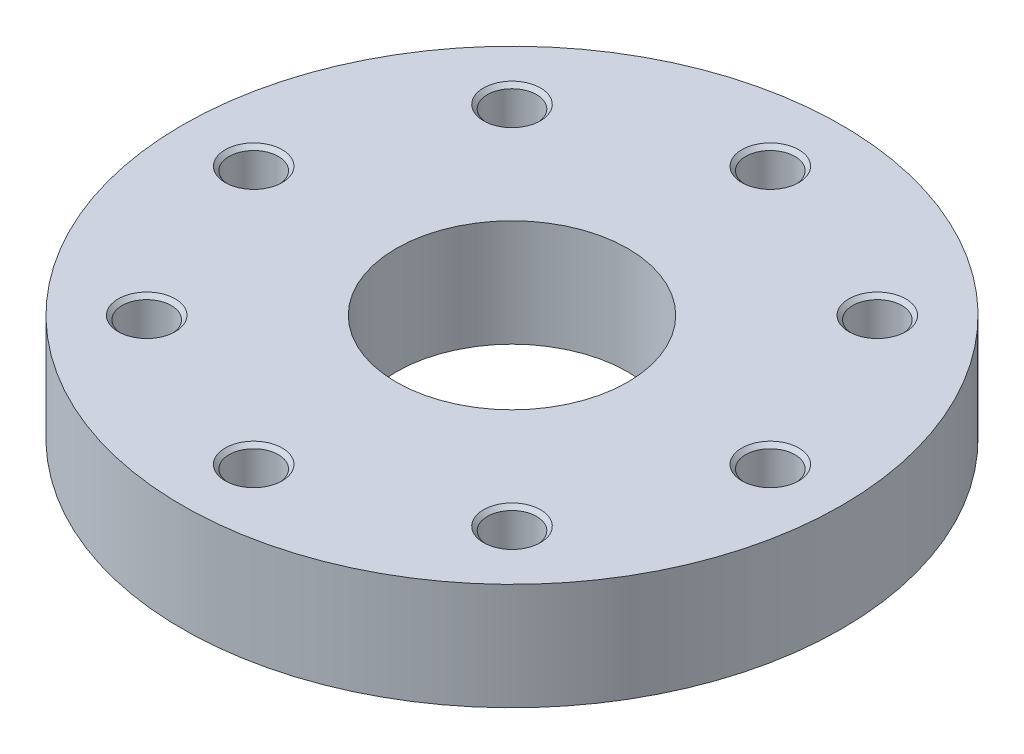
ISO-10303-21;
HEADER;
FILE_DESCRIPTION(('STEP AP214'),'2;1');
FILE_NAME('part.step','',(''),(''),'','','');
FILE_SCHEMA(('AUTOMOTIVE_DESIGN { 1 0 10303 214 1 1 1 1 }'));
ENDSEC;
DATA;
#1=APPLICATION_CONTEXT('core data for automotive mechanical design processes');
#2=APPLICATION_PROTOCOL_DEFINITION('international standard','automotive_design',2000,#1);
#3=PRODUCT_CONTEXT('',#1,'mechanical');
#4=PRODUCT('Part','Part','',(#3));
#5=PRODUCT_RELATED_PRODUCT_CATEGORY('part','',(#4));
#6=PRODUCT_DEFINITION_FORMATION('','',#4);
#7=PRODUCT_DEFINITION_CONTEXT('part definition',#1,'design');
#8=PRODUCT_DEFINITION('design','',#6,#7);
#9=PRODUCT_DEFINITION_SHAPE('','',#8);
#10=(LENGTH_UNIT() NAMED_UNIT(*) SI_UNIT(.MILLI.,.METRE.));
#11=(NAMED_UNIT(*) PLANE_ANGLE_UNIT() SI_UNIT($,.RADIAN.));
#12=(NAMED_UNIT(*) SI_UNIT($,.STERADIAN.) SOLID_ANGLE_UNIT());
#13=UNCERTAINTY_MEASURE_WITH_UNIT(LENGTH_MEASURE(1.E-05),#10,'distance_accuracy_value','');
#14=(GEOMETRIC_REPRESENTATION_CONTEXT(3) GLOBAL_UNCERTAINTY_ASSIGNED_CONTEXT((#13)) GLOBAL_UNIT_ASSIGNED_CONTEXT((#10,
#11,#12)) REPRESENTATION_CONTEXT('',''));
#15=CARTESIAN_POINT('',(0.,0.,0.));
#16=DIRECTION('',(0.,0.,1.));
#17=DIRECTION('',(1.,0.,0.));
#18=AXIS2_PLACEMENT_3D('',#15,#16,#17);
#19=CARTESIAN_POINT('',(0.,15.,0.));
#20=DIRECTION('',(0.,-1.,0.));
#21=DIRECTION('',(1.,0.,0.));
#22=AXIS2_PLACEMENT_3D('',#19,#20,#21);
#23=CYLINDRICAL_SURFACE('',#22,92.5);
#24=CARTESIAN_POINT('',(0.,0.,0.));
#25=DIRECTION('',(0.,1.,0.));
#26=DIRECTION('',(1.,0.,0.));
#27=AXIS2_PLACEMENT_3D('',#24,#25,#26);
#28=CIRCLE('',#27,92.5);
#29=CARTESIAN_POINT('',(92.5,0.,0.));
#30=VERTEX_POINT('',#29);
#31=EDGE_CURVE('E9',#30,#30,#28,.T.);
#32=ORIENTED_EDGE('',*,*,#31,.T.);
#33=EDGE_LOOP('',(#32));
#34=FACE_BOUND('',#33,.T.);
#35=CARTESIAN_POINT('',(0.,30.,0.));
#36=DIRECTION('',(0.,1.,0.));
#37=DIRECTION('',(1.,0.,0.));
#38=AXIS2_PLACEMENT_3D('',#35,#36,#37);
#39=CIRCLE('',#38,92.5);
#40=CARTESIAN_POINT('',(92.5,30.,0.));
#41=VERTEX_POINT('',#40);
#42=EDGE_CURVE('E102',#41,#41,#39,.T.);
#43=ORIENTED_EDGE('',*,*,#42,.F.);
#44=EDGE_LOOP('',(#43));
#45=FACE_BOUND('',#44,.T.);
#46=ADVANCED_FACE('F15',(#34,#45),#23,.T.);
#47=CARTESIAN_POINT('',(62.5,0.,0.));
#48=DIRECTION('',(0.,-1.,0.));
#49=DIRECTION('',(-1.,0.,0.));
#50=AXIS2_PLACEMENT_3D('',#47,#48,#49);
#51=PLANE('',#50);
#52=CARTESIAN_POINT('',(0.,0.,0.));
#53=DIRECTION('',(0.,1.,0.));
#54=DIRECTION('',(1.,0.,0.));
#55=AXIS2_PLACEMENT_3D('',#52,#53,#54);
#56=CIRCLE('',#55,32.5);
#57=CARTESIAN_POINT('',(32.5,0.,0.));
#58=VERTEX_POINT('',#57);
#59=EDGE_CURVE('E22',#58,#58,#56,.T.);
#60=ORIENTED_EDGE('',*,*,#59,.T.);
#61=EDGE_LOOP('',(#60));
#62=FACE_BOUND('',#61,.T.);
#63=ORIENTED_EDGE('',*,*,#31,.F.);
#64=EDGE_LOOP('',(#63));
#65=FACE_BOUND('',#64,.T.);
#66=ADVANCED_FACE('F351',(#62,#65),#51,.T.);
#67=CARTESIAN_POINT('',(0.,15.,0.));
#68=DIRECTION('',(0.,-1.,0.));
#69=DIRECTION('',(1.,0.,0.));
#70=AXIS2_PLACEMENT_3D('',#67,#68,#69);
#71=CYLINDRICAL_SURFACE('',#70,32.5);
#72=CARTESIAN_POINT('',(0.,30.,0.));
#73=DIRECTION('',(0.,1.,0.));
#74=DIRECTION('',(1.,0.,0.));
#75=AXIS2_PLACEMENT_3D('',#72,#73,#74);
#76=CIRCLE('',#75,32.5);
#77=CARTESIAN_POINT('',(32.5,30.,0.));
#78=VERTEX_POINT('',#77);
#79=EDGE_CURVE('E98',#78,#78,#76,.T.);
#80=ORIENTED_EDGE('',*,*,#79,.T.);
#81=EDGE_LOOP('',(#80));
#82=FACE_BOUND('',#81,.T.);
#83=ORIENTED_EDGE('',*,*,#59,.F.);
#84=EDGE_LOOP('',(#83));
#85=FACE_BOUND('',#84,.T.);
#86=ADVANCED_FACE('F99',(#82,#85),#71,.F.);
#87=CARTESIAN_POINT('',(62.5,30.,0.));
#88=DIRECTION('',(0.,1.,0.));
#89=DIRECTION('',(1.,0.,0.));
#90=AXIS2_PLACEMENT_3D('',#87,#88,#89);
#91=PLANE('',#90);
#92=ORIENTED_EDGE('',*,*,#42,.T.);
#93=EDGE_LOOP('',(#92));
#94=FACE_BOUND('',#93,.T.);
#95=ORIENTED_EDGE('',*,*,#79,.F.);
#96=EDGE_LOOP('',(#95));
#97=FACE_BOUND('',#96,.T.);
#98=CARTESIAN_POINT('',(72.5,30.,0.));
#99=DIRECTION('',(0.,-1.,0.));
#100=DIRECTION('',(1.,0.,0.));
#101=AXIS2_PLACEMENT_3D('',#98,#99,#100);
#102=CIRCLE('',#101,8.);
#103=CARTESIAN_POINT('',(80.5,30.,0.));
#104=VERTEX_POINT('',#103);
#105=EDGE_CURVE('E112',#104,#104,#102,.T.);
#106=ORIENTED_EDGE('',*,*,#105,.T.);
#107=EDGE_LOOP('',(#106));
#108=FACE_BOUND('',#107,.T.);
#109=CARTESIAN_POINT('',(51.2652416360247,30.,-51.2652416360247));
#110=DIRECTION('',(0.,-1.,0.));
#111=DIRECTION('',(0.707106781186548,0.,-0.707106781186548));
#112=AXIS2_PLACEMENT_3D('',#109,#110,#111);
#113=CIRCLE('',#112,8.);
#114=CARTESIAN_POINT('',(56.9220958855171,30.,-56.9220958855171));
#115=VERTEX_POINT('',#114);
#116=EDGE_CURVE('E124',#115,#115,#113,.T.);
#117=ORIENTED_EDGE('',*,*,#116,.T.);
#118=EDGE_LOOP('',(#117));
#119=FACE_BOUND('',#118,.T.);
#120=CARTESIAN_POINT('',(0.,30.,-72.5));
#121=DIRECTION('',(0.,-1.,0.));
#122=DIRECTION('',(0.,0.,-1.));
#123=AXIS2_PLACEMENT_3D('',#120,#121,#122);
#124=CIRCLE('',#123,8.);
#125=CARTESIAN_POINT('',(0.,30.,-80.5));
#126=VERTEX_POINT('',#125);
#127=EDGE_CURVE('E135',#126,#126,#124,.T.);
#128=ORIENTED_EDGE('',*,*,#127,.T.);
#129=EDGE_LOOP('',(#128));
#130=FACE_BOUND('',#129,.T.);
#131=CARTESIAN_POINT('',(-51.2652416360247,30.,-51.2652416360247));
#132=DIRECTION('',(0.,-1.,0.));
#133=DIRECTION('',(-0.707106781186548,0.,-0.707106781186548));
#134=AXIS2_PLACEMENT_3D('',#131,#132,#133);
#135=CIRCLE('',#134,8.);
#136=CARTESIAN_POINT('',(-56.9220958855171,30.,-56.9220958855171));
#137=VERTEX_POINT('',#136);
#138=EDGE_CURVE('E152',#137,#137,#135,.T.);
#139=ORIENTED_EDGE('',*,*,#138,.T.);
#140=EDGE_LOOP('',(#139));
#141=FACE_BOUND('',#140,.T.);
#142=CARTESIAN_POINT('',(-72.5,30.,0.));
#143=DIRECTION('',(0.,-1.,0.));
#144=DIRECTION('',(-1.,0.,0.));
#145=AXIS2_PLACEMENT_3D('',#142,#143,#144);
#146=CIRCLE('',#145,8.);
#147=CARTESIAN_POINT('',(-80.5,30.,0.));
#148=VERTEX_POINT('',#147);
#149=EDGE_CURVE('E170',#148,#148,#146,.T.);
#150=ORIENTED_EDGE('',*,*,#149,.T.);
#151=EDGE_LOOP('',(#150));
#152=FACE_BOUND('',#151,.T.);
#153=CARTESIAN_POINT('',(-51.2652416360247,30.,51.2652416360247));
#154=DIRECTION('',(0.,-1.,0.));
#155=DIRECTION('',(-0.707106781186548,0.,0.707106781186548));
#156=AXIS2_PLACEMENT_3D('',#153,#154,#155);
#157=CIRCLE('',#156,8.);
#158=CARTESIAN_POINT('',(-56.9220958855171,30.,56.9220958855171));
#159=VERTEX_POINT('',#158);
#160=EDGE_CURVE('E186',#159,#159,#157,.T.);
#161=ORIENTED_EDGE('',*,*,#160,.T.);
#162=EDGE_LOOP('',(#161));
#163=FACE_BOUND('',#162,.T.);
#164=CARTESIAN_POINT('',(0.,30.,72.5));
#165=DIRECTION('',(0.,-1.,0.));
#166=DIRECTION('',(0.,0.,1.));
#167=AXIS2_PLACEMENT_3D('',#164,#165,#166);
#168=CIRCLE('',#167,8.);
#169=CARTESIAN_POINT('',(0.,30.,80.5));
#170=VERTEX_POINT('',#169);
#171=EDGE_CURVE('E205',#170,#170,#168,.T.);
#172=ORIENTED_EDGE('',*,*,#171,.T.);
#173=EDGE_LOOP('',(#172));
#174=FACE_BOUND('',#173,.T.);
#175=CARTESIAN_POINT('',(51.2652416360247,30.,51.2652416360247));
#176=DIRECTION('',(0.,-1.,0.));
#177=DIRECTION('',(0.707106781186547,0.,0.707106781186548));
#178=AXIS2_PLACEMENT_3D('',#175,#176,#177);
#179=CIRCLE('',#178,8.);
#180=CARTESIAN_POINT('',(56.9220958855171,30.,56.9220958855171));
#181=VERTEX_POINT('',#180);
#182=EDGE_CURVE('E221',#181,#181,#179,.T.);
#183=ORIENTED_EDGE('',*,*,#182,.T.);
#184=EDGE_LOOP('',(#183));
#185=FACE_BOUND('',#184,.T.);
#186=ADVANCED_FACE('F236',(#94,#97,#108,#119,#130,#141,#152,#163,#174,#185),#91,.T.);
#187=CARTESIAN_POINT('',(72.5,5.00308975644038,0.));
#188=DIRECTION('',(0.,1.,0.));
#189=DIRECTION('',(1.,0.,0.));
#190=AXIS2_PLACEMENT_3D('',#187,#188,#189);
#191=CONICAL_SURFACE('',#190,3.45875,1.0471975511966);
#192=CARTESIAN_POINT('',(72.5,7.,0.));
#193=DIRECTION('',(0.,-1.,0.));
#194=DIRECTION('',(1.,0.,0.));
#195=AXIS2_PLACEMENT_3D('',#192,#193,#194);
#196=CIRCLE('',#195,6.9175);
#197=CARTESIAN_POINT('',(79.4175,7.,0.));
#198=VERTEX_POINT('',#197);
#199=EDGE_CURVE('E103',#198,#198,#196,.T.);
#200=ORIENTED_EDGE('',*,*,#199,.F.);
#201=EDGE_LOOP('',(#200));
#202=FACE_BOUND('',#201,.T.);
#203=CARTESIAN_POINT('',(72.5,3.00617951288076,0.));
#204=VERTEX_POINT('',#203);
#205=VERTEX_LOOP('',#204);
#206=FACE_BOUND('',#205,.T.);
#207=ADVANCED_FACE('F359',(#202,#206),#191,.F.);
#208=CARTESIAN_POINT('',(72.5,9.95875,0.));
#209=DIRECTION('',(0.,1.,0.));
#210=DIRECTION('',(1.,0.,0.));
#211=AXIS2_PLACEMENT_3D('',#208,#209,#210);
#212=CYLINDRICAL_SURFACE('',#211,6.9175);
#213=CARTESIAN_POINT('',(72.5,12.9175,0.));
#214=DIRECTION('',(0.,-1.,0.));
#215=DIRECTION('',(1.,0.,0.));
#216=AXIS2_PLACEMENT_3D('',#213,#214,#215);
#217=CIRCLE('',#216,6.9175);
#218=CARTESIAN_POINT('',(79.4175,12.9175,0.));
#219=VERTEX_POINT('',#218);
#220=EDGE_CURVE('E105',#219,#219,#217,.T.);
#221=ORIENTED_EDGE('',*,*,#220,.F.);
#222=EDGE_LOOP('',(#221));
#223=FACE_BOUND('',#222,.T.);
#224=ORIENTED_EDGE('',*,*,#199,.T.);
#225=EDGE_LOOP('',(#224));
#226=FACE_BOUND('',#225,.T.);
#227=ADVANCED_FACE('F451',(#223,#226),#212,.F.);
#228=CARTESIAN_POINT('',(72.5,13.45875,0.));
#229=DIRECTION('',(0.,1.,0.));
#230=DIRECTION('',(1.,0.,0.));
#231=AXIS2_PLACEMENT_3D('',#228,#229,#230);
#232=CONICAL_SURFACE('',#231,7.45875,0.785398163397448);
#233=CARTESIAN_POINT('',(72.5,14.,0.));
#234=DIRECTION('',(0.,-1.,0.));
#235=DIRECTION('',(1.,0.,0.));
#236=AXIS2_PLACEMENT_3D('',#233,#234,#235);
#237=CIRCLE('',#236,8.);
#238=CARTESIAN_POINT('',(80.5,14.,0.));
#239=VERTEX_POINT('',#238);
#240=EDGE_CURVE('E109',#239,#239,#237,.T.);
#241=ORIENTED_EDGE('',*,*,#240,.F.);
#242=EDGE_LOOP('',(#241));
#243=FACE_BOUND('',#242,.T.);
#244=ORIENTED_EDGE('',*,*,#220,.T.);
#245=EDGE_LOOP('',(#244));
#246=FACE_BOUND('',#245,.T.);
#247=ADVANCED_FACE('F453',(#243,#246),#232,.F.);
#248=CARTESIAN_POINT('',(79.95875,14.,0.));
#249=DIRECTION('',(0.,1.,0.));
#250=DIRECTION('',(-1.,0.,0.));
#251=AXIS2_PLACEMENT_3D('',#248,#249,#250);
#252=PLANE('',#251);
#253=CARTESIAN_POINT('',(72.5,14.,0.));
#254=DIRECTION('',(0.,-1.,0.));
#255=DIRECTION('',(1.,0.,0.));
#256=AXIS2_PLACEMENT_3D('',#253,#254,#255);
#257=CIRCLE('',#256,6.9175);
#258=CARTESIAN_POINT('',(79.4175,14.,0.));
#259=VERTEX_POINT('',#258);
#260=EDGE_CURVE('E111',#259,#259,#257,.T.);
#261=ORIENTED_EDGE('',*,*,#260,.F.);
#262=EDGE_LOOP('',(#261));
#263=FACE_BOUND('',#262,.T.);
#264=ORIENTED_EDGE('',*,*,#240,.T.);
#265=EDGE_LOOP('',(#264));
#266=FACE_BOUND('',#265,.T.);
#267=ADVANCED_FACE('F459',(#263,#266),#252,.F.);
#268=CARTESIAN_POINT('',(72.5,21.45875,0.));
#269=DIRECTION('',(0.,1.,0.));
#270=DIRECTION('',(1.,0.,0.));
#271=AXIS2_PLACEMENT_3D('',#268,#269,#270);
#272=CYLINDRICAL_SURFACE('',#271,6.9175);
#273=CARTESIAN_POINT('',(72.5,28.9175,0.));
#274=DIRECTION('',(0.,-1.,0.));
#275=DIRECTION('',(1.,0.,0.));
#276=AXIS2_PLACEMENT_3D('',#273,#274,#275);
#277=CIRCLE('',#276,6.9175);
#278=CARTESIAN_POINT('',(79.4175,28.9175,0.));
#279=VERTEX_POINT('',#278);
#280=EDGE_CURVE('E114',#279,#279,#277,.T.);
#281=ORIENTED_EDGE('',*,*,#280,.F.);
#282=EDGE_LOOP('',(#281));
#283=FACE_BOUND('',#282,.T.);
#284=ORIENTED_EDGE('',*,*,#260,.T.);
#285=EDGE_LOOP('',(#284));
#286=FACE_BOUND('',#285,.T.);
#287=ADVANCED_FACE('F510',(#283,#286),#272,.F.);
#288=CARTESIAN_POINT('',(72.5,29.45875,0.));
#289=DIRECTION('',(0.,1.,0.));
#290=DIRECTION('',(1.,0.,0.));
#291=AXIS2_PLACEMENT_3D('',#288,#289,#290);
#292=CONICAL_SURFACE('',#291,7.45875,0.785398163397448);
#293=ORIENTED_EDGE('',*,*,#105,.F.);
#294=EDGE_LOOP('',(#293));
#295=FACE_BOUND('',#294,.T.);
#296=ORIENTED_EDGE('',*,*,#280,.T.);
#297=EDGE_LOOP('',(#296));
#298=FACE_BOUND('',#297,.T.);
#299=ADVANCED_FACE('F519',(#295,#298),#292,.F.);
#300=CARTESIAN_POINT('',(51.2652416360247,5.00308975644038,-51.2652416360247));
#301=DIRECTION('',(0.,1.,0.));
#302=DIRECTION('',(0.707106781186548,0.,-0.707106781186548));
#303=AXIS2_PLACEMENT_3D('',#300,#301,#302);
#304=CONICAL_SURFACE('',#303,3.45875,1.0471975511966);
#305=CARTESIAN_POINT('',(51.2652416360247,7.,-51.2652416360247));
#306=DIRECTION('',(0.,-1.,0.));
#307=DIRECTION('',(0.707106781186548,0.,-0.707106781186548));
#308=AXIS2_PLACEMENT_3D('',#305,#306,#307);
#309=CIRCLE('',#308,6.9175);
#310=CARTESIAN_POINT('',(56.1566527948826,7.,-56.1566527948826));
#311=VERTEX_POINT('',#310);
#312=EDGE_CURVE('E116',#311,#311,#309,.T.);
#313=ORIENTED_EDGE('',*,*,#312,.F.);
#314=EDGE_LOOP('',(#313));
#315=FACE_BOUND('',#314,.T.);
#316=CARTESIAN_POINT('',(51.2652416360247,3.00617951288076,-51.2652416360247));
#317=VERTEX_POINT('',#316);
#318=VERTEX_LOOP('',#317);
#319=FACE_BOUND('',#318,.T.);
#320=ADVANCED_FACE('F529',(#315,#319),#304,.F.);
#321=CARTESIAN_POINT('',(51.2652416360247,9.95875,-51.2652416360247));
#322=DIRECTION('',(0.,1.,0.));
#323=DIRECTION('',(0.707106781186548,0.,-0.707106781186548));
#324=AXIS2_PLACEMENT_3D('',#321,#322,#323);
#325=CYLINDRICAL_SURFACE('',#324,6.9175);
#326=CARTESIAN_POINT('',(51.2652416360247,12.9175,-51.2652416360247));
#327=DIRECTION('',(0.,-1.,0.));
#328=DIRECTION('',(0.707106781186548,0.,-0.707106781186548));
#329=AXIS2_PLACEMENT_3D('',#326,#327,#328);
#330=CIRCLE('',#329,6.9175);
#331=CARTESIAN_POINT('',(56.1566527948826,12.9175,-56.1566527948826));
#332=VERTEX_POINT('',#331);
#333=EDGE_CURVE('E118',#332,#332,#330,.T.);
#334=ORIENTED_EDGE('',*,*,#333,.F.);
#335=EDGE_LOOP('',(#334));
#336=FACE_BOUND('',#335,.T.);
#337=ORIENTED_EDGE('',*,*,#312,.T.);
#338=EDGE_LOOP('',(#337));
#339=FACE_BOUND('',#338,.T.);
#340=ADVANCED_FACE('F539',(#336,#339),#325,.F.);
#341=CARTESIAN_POINT('',(51.2652416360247,13.45875,-51.2652416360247));
#342=DIRECTION('',(0.,1.,0.));
#343=DIRECTION('',(0.707106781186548,0.,-0.707106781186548));
#344=AXIS2_PLACEMENT_3D('',#341,#342,#343);
#345=CONICAL_SURFACE('',#344,7.45875,0.785398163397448);
#346=CARTESIAN_POINT('',(51.2652416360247,14.,-51.2652416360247));
#347=DIRECTION('',(0.,-1.,0.));
#348=DIRECTION('',(0.707106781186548,0.,-0.707106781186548));
#349=AXIS2_PLACEMENT_3D('',#346,#347,#348);
#350=CIRCLE('',#349,8.);
#351=CARTESIAN_POINT('',(56.9220958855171,14.,-56.9220958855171));
#352=VERTEX_POINT('',#351);
#353=EDGE_CURVE('E120',#352,#352,#350,.T.);
#354=ORIENTED_EDGE('',*,*,#353,.F.);
#355=EDGE_LOOP('',(#354));
#356=FACE_BOUND('',#355,.T.);
#357=ORIENTED_EDGE('',*,*,#333,.T.);
#358=EDGE_LOOP('',(#357));
#359=FACE_BOUND('',#358,.T.);
#360=ADVANCED_FACE('F549',(#356,#359),#345,.F.);
#361=CARTESIAN_POINT('',(56.5393743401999,14.,-56.5393743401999));
#362=DIRECTION('',(0.,1.,0.));
#363=DIRECTION('',(-0.707106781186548,0.,0.707106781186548));
#364=AXIS2_PLACEMENT_3D('',#361,#362,#363);
#365=PLANE('',#364);
#366=CARTESIAN_POINT('',(51.2652416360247,14.,-51.2652416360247));
#367=DIRECTION('',(0.,-1.,0.));
#368=DIRECTION('',(0.707106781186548,0.,-0.707106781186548));
#369=AXIS2_PLACEMENT_3D('',#366,#367,#368);
#370=CIRCLE('',#369,6.9175);
#371=CARTESIAN_POINT('',(56.1566527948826,14.,-56.1566527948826));
#372=VERTEX_POINT('',#371);
#373=EDGE_CURVE('E122',#372,#372,#370,.T.);
#374=ORIENTED_EDGE('',*,*,#373,.F.);
#375=EDGE_LOOP('',(#374));
#376=FACE_BOUND('',#375,.T.);
#377=ORIENTED_EDGE('',*,*,#353,.T.);
#378=EDGE_LOOP('',(#377));
#379=FACE_BOUND('',#378,.T.);
#380=ADVANCED_FACE('F559',(#376,#379),#365,.F.);
#381=CARTESIAN_POINT('',(51.2652416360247,21.45875,-51.2652416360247));
#382=DIRECTION('',(0.,1.,0.));
#383=DIRECTION('',(0.707106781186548,0.,-0.707106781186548));
#384=AXIS2_PLACEMENT_3D('',#381,#382,#383);
#385=CYLINDRICAL_SURFACE('',#384,6.9175);
#386=CARTESIAN_POINT('',(51.2652416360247,28.9175,-51.2652416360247));
#387=DIRECTION('',(0.,-1.,0.));
#388=DIRECTION('',(0.707106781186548,0.,-0.707106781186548));
#389=AXIS2_PLACEMENT_3D('',#386,#387,#388);
#390=CIRCLE('',#389,6.9175);
#391=CARTESIAN_POINT('',(56.1566527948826,28.9175,-56.1566527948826));
#392=VERTEX_POINT('',#391);
#393=EDGE_CURVE('E125',#392,#392,#390,.T.);
#394=ORIENTED_EDGE('',*,*,#393,.F.);
#395=EDGE_LOOP('',(#394));
#396=FACE_BOUND('',#395,.T.);
#397=ORIENTED_EDGE('',*,*,#373,.T.);
#398=EDGE_LOOP('',(#397));
#399=FACE_BOUND('',#398,.T.);
#400=ADVANCED_FACE('F569',(#396,#399),#385,.F.);
#401=CARTESIAN_POINT('',(51.2652416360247,29.45875,-51.2652416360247));
#402=DIRECTION('',(0.,1.,0.));
#403=DIRECTION('',(0.707106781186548,0.,-0.707106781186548));
#404=AXIS2_PLACEMENT_3D('',#401,#402,#403);
#405=CONICAL_SURFACE('',#404,7.45875,0.785398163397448);
#406=ORIENTED_EDGE('',*,*,#116,.F.);
#407=EDGE_LOOP('',(#406));
#408=FACE_BOUND('',#407,.T.);
#409=ORIENTED_EDGE('',*,*,#393,.T.);
#410=EDGE_LOOP('',(#409));
#411=FACE_BOUND('',#410,.T.);
#412=ADVANCED_FACE('F579',(#408,#411),#405,.F.);
#413=CARTESIAN_POINT('',(0.,5.00308975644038,-72.5));
#414=DIRECTION('',(0.,1.,0.));
#415=DIRECTION('',(0.,0.,-1.));
#416=AXIS2_PLACEMENT_3D('',#413,#414,#415);
#417=CONICAL_SURFACE('',#416,3.45875,1.0471975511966);
#418=CARTESIAN_POINT('',(0.,7.,-72.5));
#419=DIRECTION('',(0.,-1.,0.));
#420=DIRECTION('',(0.,0.,-1.));
#421=AXIS2_PLACEMENT_3D('',#418,#419,#420);
#422=CIRCLE('',#421,6.9175);
#423=CARTESIAN_POINT('',(0.,7.,-79.4175));
#424=VERTEX_POINT('',#423);
#425=EDGE_CURVE('E127',#424,#424,#422,.T.);
#426=ORIENTED_EDGE('',*,*,#425,.F.);
#427=EDGE_LOOP('',(#426));
#428=FACE_BOUND('',#427,.T.);
#429=CARTESIAN_POINT('',(0.,3.00617951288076,-72.5));
#430=VERTEX_POINT('',#429);
#431=VERTEX_LOOP('',#430);
#432=FACE_BOUND('',#431,.T.);
#433=ADVANCED_FACE('F589',(#428,#432),#417,.F.);
#434=CARTESIAN_POINT('',(0.,9.95875,-72.5));
#435=DIRECTION('',(0.,1.,0.));
#436=DIRECTION('',(0.,0.,-1.));
#437=AXIS2_PLACEMENT_3D('',#434,#435,#436);
#438=CYLINDRICAL_SURFACE('',#437,6.9175);
#439=CARTESIAN_POINT('',(0.,12.9175,-72.5));
#440=DIRECTION('',(0.,-1.,0.));
#441=DIRECTION('',(0.,0.,-1.));
#442=AXIS2_PLACEMENT_3D('',#439,#440,#441);
#443=CIRCLE('',#442,6.9175);
#444=CARTESIAN_POINT('',(0.,12.9175,-79.4175));
#445=VERTEX_POINT('',#444);
#446=EDGE_CURVE('E129',#445,#445,#443,.T.);
#447=ORIENTED_EDGE('',*,*,#446,.F.);
#448=EDGE_LOOP('',(#447));
#449=FACE_BOUND('',#448,.T.);
#450=ORIENTED_EDGE('',*,*,#425,.T.);
#451=EDGE_LOOP('',(#450));
#452=FACE_BOUND('',#451,.T.);
#453=ADVANCED_FACE('F599',(#449,#452),#438,.F.);
#454=CARTESIAN_POINT('',(0.,13.45875,-72.5));
#455=DIRECTION('',(0.,1.,0.));
#456=DIRECTION('',(0.,0.,-1.));
#457=AXIS2_PLACEMENT_3D('',#454,#455,#456);
#458=CONICAL_SURFACE('',#457,7.45875,0.785398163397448);
#459=CARTESIAN_POINT('',(0.,14.,-72.5));
#460=DIRECTION('',(0.,-1.,0.));
#461=DIRECTION('',(0.,0.,-1.));
#462=AXIS2_PLACEMENT_3D('',#459,#460,#461);
#463=CIRCLE('',#462,8.);
#464=CARTESIAN_POINT('',(0.,14.,-80.5));
#465=VERTEX_POINT('',#464);
#466=EDGE_CURVE('E131',#465,#465,#463,.T.);
#467=ORIENTED_EDGE('',*,*,#466,.F.);
#468=EDGE_LOOP('',(#467));
#469=FACE_BOUND('',#468,.T.);
#470=ORIENTED_EDGE('',*,*,#446,.T.);
#471=EDGE_LOOP('',(#470));
#472=FACE_BOUND('',#471,.T.);
#473=ADVANCED_FACE('F609',(#469,#472),#458,.F.);
#474=CARTESIAN_POINT('',(0.,14.,-79.95875));
#475=DIRECTION('',(0.,1.,0.));
#476=DIRECTION('',(0.,0.,1.));
#477=AXIS2_PLACEMENT_3D('',#474,#475,#476);
#478=PLANE('',#477);
#479=CARTESIAN_POINT('',(0.,14.,-72.5));
#480=DIRECTION('',(0.,-1.,0.));
#481=DIRECTION('',(0.,0.,-1.));
#482=AXIS2_PLACEMENT_3D('',#479,#480,#481);
#483=CIRCLE('',#482,6.9175);
#484=CARTESIAN_POINT('',(0.,14.,-79.4175));
#485=VERTEX_POINT('',#484);
#486=EDGE_CURVE('E133',#485,#485,#483,.T.);
#487=ORIENTED_EDGE('',*,*,#486,.F.);
#488=EDGE_LOOP('',(#487));
#489=FACE_BOUND('',#488,.T.);
#490=ORIENTED_EDGE('',*,*,#466,.T.);
#491=EDGE_LOOP('',(#490));
#492=FACE_BOUND('',#491,.T.);
#493=ADVANCED_FACE('F619',(#489,#492),#478,.F.);
#494=CARTESIAN_POINT('',(0.,21.45875,-72.5));
#495=DIRECTION('',(0.,1.,0.));
#496=DIRECTION('',(0.,0.,-1.));
#497=AXIS2_PLACEMENT_3D('',#494,#495,#496);
#498=CYLINDRICAL_SURFACE('',#497,6.9175);
#499=CARTESIAN_POINT('',(0.,28.9175,-72.5));
#500=DIRECTION('',(0.,-1.,0.));
#501=DIRECTION('',(0.,0.,-1.));
#502=AXIS2_PLACEMENT_3D('',#499,#500,#501);
#503=CIRCLE('',#502,6.9175);
#504=CARTESIAN_POINT('',(0.,28.9175,-79.4175));
#505=VERTEX_POINT('',#504);
#506=EDGE_CURVE('E137',#505,#505,#503,.T.);
#507=ORIENTED_EDGE('',*,*,#506,.F.);
#508=EDGE_LOOP('',(#507));
#509=FACE_BOUND('',#508,.T.);
#510=ORIENTED_EDGE('',*,*,#486,.T.);
#511=EDGE_LOOP('',(#510));
#512=FACE_BOUND('',#511,.T.);
#513=ADVANCED_FACE('F346',(#509,#512),#498,.F.);
#514=CARTESIAN_POINT('',(0.,29.45875,-72.5));
#515=DIRECTION('',(0.,1.,0.));
#516=DIRECTION('',(0.,0.,-1.));
#517=AXIS2_PLACEMENT_3D('',#514,#515,#516);
#518=CONICAL_SURFACE('',#517,7.45875,0.785398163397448);
#519=ORIENTED_EDGE('',*,*,#127,.F.);
#520=EDGE_LOOP('',(#519));
#521=FACE_BOUND('',#520,.T.);
#522=ORIENTED_EDGE('',*,*,#506,.T.);
#523=EDGE_LOOP('',(#522));
#524=FACE_BOUND('',#523,.T.);
#525=ADVANCED_FACE('F335',(#521,#524),#518,.F.);
#526=CARTESIAN_POINT('',(-51.2652416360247,5.00308975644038,-51.2652416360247));
#527=DIRECTION('',(0.,1.,0.));
#528=DIRECTION('',(-0.707106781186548,0.,-0.707106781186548));
#529=AXIS2_PLACEMENT_3D('',#526,#527,#528);
#530=CONICAL_SURFACE('',#529,3.45875,1.0471975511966);
#531=CARTESIAN_POINT('',(-51.2652416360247,7.,-51.2652416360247));
#532=DIRECTION('',(0.,-1.,0.));
#533=DIRECTION('',(-0.707106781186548,0.,-0.707106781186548));
#534=AXIS2_PLACEMENT_3D('',#531,#532,#533);
#535=CIRCLE('',#534,6.9175);
#536=CARTESIAN_POINT('',(-56.1566527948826,7.,-56.1566527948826));
#537=VERTEX_POINT('',#536);
#538=EDGE_CURVE('E140',#537,#537,#535,.T.);
#539=ORIENTED_EDGE('',*,*,#538,.F.);
#540=EDGE_LOOP('',(#539));
#541=FACE_BOUND('',#540,.T.);
#542=CARTESIAN_POINT('',(-51.2652416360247,3.00617951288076,-51.2652416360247));
#543=VERTEX_POINT('',#542);
#544=VERTEX_LOOP('',#543);
#545=FACE_BOUND('',#544,.T.);
#546=ADVANCED_FACE('F332',(#541,#545),#530,.F.);
#547=CARTESIAN_POINT('',(-51.2652416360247,9.95875,-51.2652416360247));
#548=DIRECTION('',(0.,1.,0.));
#549=DIRECTION('',(-0.707106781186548,0.,-0.707106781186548));
#550=AXIS2_PLACEMENT_3D('',#547,#548,#549);
#551=CYLINDRICAL_SURFACE('',#550,6.9175);
#552=CARTESIAN_POINT('',(-51.2652416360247,12.9175,-51.2652416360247));
#553=DIRECTION('',(0.,-1.,0.));
#554=DIRECTION('',(-0.707106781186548,0.,-0.707106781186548));
#555=AXIS2_PLACEMENT_3D('',#552,#553,#554);
#556=CIRCLE('',#555,6.9175);
#557=CARTESIAN_POINT('',(-56.1566527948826,12.9175,-56.1566527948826));
#558=VERTEX_POINT('',#557);
#559=EDGE_CURVE('E143',#558,#558,#556,.T.);
#560=ORIENTED_EDGE('',*,*,#559,.F.);
#561=EDGE_LOOP('',(#560));
#562=FACE_BOUND('',#561,.T.);
#563=ORIENTED_EDGE('',*,*,#538,.T.);
#564=EDGE_LOOP('',(#563));
#565=FACE_BOUND('',#564,.T.);
#566=ADVANCED_FACE('F334',(#562,#565),#551,.F.);
#567=CARTESIAN_POINT('',(-51.2652416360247,13.45875,-51.2652416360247));
#568=DIRECTION('',(0.,1.,0.));
#569=DIRECTION('',(-0.707106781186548,0.,-0.707106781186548));
#570=AXIS2_PLACEMENT_3D('',#567,#568,#569);
#571=CONICAL_SURFACE('',#570,7.45875,0.785398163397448);
#572=CARTESIAN_POINT('',(-51.2652416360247,14.,-51.2652416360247));
#573=DIRECTION('',(0.,-1.,0.));
#574=DIRECTION('',(-0.707106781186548,0.,-0.707106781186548));
#575=AXIS2_PLACEMENT_3D('',#572,#573,#574);
#576=CIRCLE('',#575,8.);
#577=CARTESIAN_POINT('',(-56.9220958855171,14.,-56.9220958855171));
#578=VERTEX_POINT('',#577);
#579=EDGE_CURVE('E146',#578,#578,#576,.T.);
#580=ORIENTED_EDGE('',*,*,#579,.F.);
#581=EDGE_LOOP('',(#580));
#582=FACE_BOUND('',#581,.T.);
#583=ORIENTED_EDGE('',*,*,#559,.T.);
#584=EDGE_LOOP('',(#583));
#585=FACE_BOUND('',#584,.T.);
#586=ADVANCED_FACE('F343',(#582,#585),#571,.F.);
#587=CARTESIAN_POINT('',(-56.5393743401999,14.,-56.5393743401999));
#588=DIRECTION('',(0.,1.,0.));
#589=DIRECTION('',(0.707106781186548,0.,0.707106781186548));
#590=AXIS2_PLACEMENT_3D('',#587,#588,#589);
#591=PLANE('',#590);
#592=CARTESIAN_POINT('',(-51.2652416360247,14.,-51.2652416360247));
#593=DIRECTION('',(0.,-1.,0.));
#594=DIRECTION('',(-0.707106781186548,0.,-0.707106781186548));
#595=AXIS2_PLACEMENT_3D('',#592,#593,#594);
#596=CIRCLE('',#595,6.9175);
#597=CARTESIAN_POINT('',(-56.1566527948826,14.,-56.1566527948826));
#598=VERTEX_POINT('',#597);
#599=EDGE_CURVE('E148',#598,#598,#596,.T.);
#600=ORIENTED_EDGE('',*,*,#599,.F.);
#601=EDGE_LOOP('',(#600));
#602=FACE_BOUND('',#601,.T.);
#603=ORIENTED_EDGE('',*,*,#579,.T.);
#604=EDGE_LOOP('',(#603));
#605=FACE_BOUND('',#604,.T.);
#606=ADVANCED_FACE('F443',(#602,#605),#591,.F.);
#607=CARTESIAN_POINT('',(-51.2652416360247,21.45875,-51.2652416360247));
#608=DIRECTION('',(0.,1.,0.));
#609=DIRECTION('',(-0.707106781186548,0.,-0.707106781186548));
#610=AXIS2_PLACEMENT_3D('',#607,#608,#609);
#611=CYLINDRICAL_SURFACE('',#610,6.9175);
#612=CARTESIAN_POINT('',(-51.2652416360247,28.9175,-51.2652416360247));
#613=DIRECTION('',(0.,-1.,0.));
#614=DIRECTION('',(-0.707106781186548,0.,-0.707106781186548));
#615=AXIS2_PLACEMENT_3D('',#612,#613,#614);
#616=CIRCLE('',#615,6.9175);
#617=CARTESIAN_POINT('',(-56.1566527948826,28.9175,-56.1566527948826));
#618=VERTEX_POINT('',#617);
#619=EDGE_CURVE('E155',#618,#618,#616,.T.);
#620=ORIENTED_EDGE('',*,*,#619,.F.);
#621=EDGE_LOOP('',(#620));
#622=FACE_BOUND('',#621,.T.);
#623=ORIENTED_EDGE('',*,*,#599,.T.);
#624=EDGE_LOOP('',(#623));
#625=FACE_BOUND('',#624,.T.);
#626=ADVANCED_FACE('F439',(#622,#625),#611,.F.);
#627=CARTESIAN_POINT('',(-51.2652416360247,29.45875,-51.2652416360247));
#628=DIRECTION('',(0.,1.,0.));
#629=DIRECTION('',(-0.707106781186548,0.,-0.707106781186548));
#630=AXIS2_PLACEMENT_3D('',#627,#628,#629);
#631=CONICAL_SURFACE('',#630,7.45875,0.785398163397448);
#632=ORIENTED_EDGE('',*,*,#138,.F.);
#633=EDGE_LOOP('',(#632));
#634=FACE_BOUND('',#633,.T.);
#635=ORIENTED_EDGE('',*,*,#619,.T.);
#636=EDGE_LOOP('',(#635));
#637=FACE_BOUND('',#636,.T.);
#638=ADVANCED_FACE('F435',(#634,#637),#631,.F.);
#639=CARTESIAN_POINT('',(-72.5,5.00308975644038,0.));
#640=DIRECTION('',(0.,1.,0.));
#641=DIRECTION('',(-1.,0.,0.));
#642=AXIS2_PLACEMENT_3D('',#639,#640,#641);
#643=CONICAL_SURFACE('',#642,3.45875,1.0471975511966);
#644=CARTESIAN_POINT('',(-72.5,7.,0.));
#645=DIRECTION('',(0.,-1.,0.));
#646=DIRECTION('',(-1.,0.,0.));
#647=AXIS2_PLACEMENT_3D('',#644,#645,#646);
#648=CIRCLE('',#647,6.9175);
#649=CARTESIAN_POINT('',(-79.4175,7.,0.));
#650=VERTEX_POINT('',#649);
#651=EDGE_CURVE('E158',#650,#650,#648,.T.);
#652=ORIENTED_EDGE('',*,*,#651,.F.);
#653=EDGE_LOOP('',(#652));
#654=FACE_BOUND('',#653,.T.);
#655=CARTESIAN_POINT('',(-72.5,3.00617951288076,0.));
#656=VERTEX_POINT('',#655);
#657=VERTEX_LOOP('',#656);
#658=FACE_BOUND('',#657,.T.);
#659=ADVANCED_FACE('F431',(#654,#658),#643,.F.);
#660=CARTESIAN_POINT('',(-72.5,9.95875,0.));
#661=DIRECTION('',(0.,1.,0.));
#662=DIRECTION('',(-1.,0.,0.));
#663=AXIS2_PLACEMENT_3D('',#660,#661,#662);
#664=CYLINDRICAL_SURFACE('',#663,6.9175);
#665=CARTESIAN_POINT('',(-72.5,12.9175,0.));
#666=DIRECTION('',(0.,-1.,0.));
#667=DIRECTION('',(-1.,0.,0.));
#668=AXIS2_PLACEMENT_3D('',#665,#666,#667);
#669=CIRCLE('',#668,6.9175);
#670=CARTESIAN_POINT('',(-79.4175,12.9175,0.));
#671=VERTEX_POINT('',#670);
#672=EDGE_CURVE('E161',#671,#671,#669,.T.);
#673=ORIENTED_EDGE('',*,*,#672,.F.);
#674=EDGE_LOOP('',(#673));
#675=FACE_BOUND('',#674,.T.);
#676=ORIENTED_EDGE('',*,*,#651,.T.);
#677=EDGE_LOOP('',(#676));
#678=FACE_BOUND('',#677,.T.);
#679=ADVANCED_FACE('F427',(#675,#678),#664,.F.);
#680=CARTESIAN_POINT('',(-72.5,13.45875,0.));
#681=DIRECTION('',(0.,1.,0.));
#682=DIRECTION('',(-1.,0.,0.));
#683=AXIS2_PLACEMENT_3D('',#680,#681,#682);
#684=CONICAL_SURFACE('',#683,7.45875,0.785398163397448);
#685=CARTESIAN_POINT('',(-72.5,14.,0.));
#686=DIRECTION('',(0.,-1.,0.));
#687=DIRECTION('',(-1.,0.,0.));
#688=AXIS2_PLACEMENT_3D('',#685,#686,#687);
#689=CIRCLE('',#688,8.);
#690=CARTESIAN_POINT('',(-80.5,14.,0.));
#691=VERTEX_POINT('',#690);
#692=EDGE_CURVE('E164',#691,#691,#689,.T.);
#693=ORIENTED_EDGE('',*,*,#692,.F.);
#694=EDGE_LOOP('',(#693));
#695=FACE_BOUND('',#694,.T.);
#696=ORIENTED_EDGE('',*,*,#672,.T.);
#697=EDGE_LOOP('',(#696));
#698=FACE_BOUND('',#697,.T.);
#699=ADVANCED_FACE('F423',(#695,#698),#684,.F.);
#700=CARTESIAN_POINT('',(-79.95875,14.,0.));
#701=DIRECTION('',(0.,1.,0.));
#702=DIRECTION('',(1.,0.,0.));
#703=AXIS2_PLACEMENT_3D('',#700,#701,#702);
#704=PLANE('',#703);
#705=CARTESIAN_POINT('',(-72.5,14.,0.));
#706=DIRECTION('',(0.,-1.,0.));
#707=DIRECTION('',(-1.,0.,0.));
#708=AXIS2_PLACEMENT_3D('',#705,#706,#707);
#709=CIRCLE('',#708,6.9175);
#710=CARTESIAN_POINT('',(-79.4175,14.,0.));
#711=VERTEX_POINT('',#710);
#712=EDGE_CURVE('E167',#711,#711,#709,.T.);
#713=ORIENTED_EDGE('',*,*,#712,.F.);
#714=EDGE_LOOP('',(#713));
#715=FACE_BOUND('',#714,.T.);
#716=ORIENTED_EDGE('',*,*,#692,.T.);
#717=EDGE_LOOP('',(#716));
#718=FACE_BOUND('',#717,.T.);
#719=ADVANCED_FACE('F419',(#715,#718),#704,.F.);
#720=CARTESIAN_POINT('',(-72.5,21.45875,0.));
#721=DIRECTION('',(0.,1.,0.));
#722=DIRECTION('',(-1.,0.,0.));
#723=AXIS2_PLACEMENT_3D('',#720,#721,#722);
#724=CYLINDRICAL_SURFACE('',#723,6.9175);
#725=CARTESIAN_POINT('',(-72.5,28.9175,0.));
#726=DIRECTION('',(0.,-1.,0.));
#727=DIRECTION('',(-1.,0.,0.));
#728=AXIS2_PLACEMENT_3D('',#725,#726,#727);
#729=CIRCLE('',#728,6.9175);
#730=CARTESIAN_POINT('',(-79.4175,28.9175,0.));
#731=VERTEX_POINT('',#730);
#732=EDGE_CURVE('E173',#731,#731,#729,.T.);
#733=ORIENTED_EDGE('',*,*,#732,.F.);
#734=EDGE_LOOP('',(#733));
#735=FACE_BOUND('',#734,.T.);
#736=ORIENTED_EDGE('',*,*,#712,.T.);
#737=EDGE_LOOP('',(#736));
#738=FACE_BOUND('',#737,.T.);
#739=ADVANCED_FACE('F413',(#735,#738),#724,.F.);
#740=CARTESIAN_POINT('',(-72.5,29.45875,0.));
#741=DIRECTION('',(0.,1.,0.));
#742=DIRECTION('',(-1.,0.,0.));
#743=AXIS2_PLACEMENT_3D('',#740,#741,#742);
#744=CONICAL_SURFACE('',#743,7.45875,0.785398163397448);
#745=ORIENTED_EDGE('',*,*,#149,.F.);
#746=EDGE_LOOP('',(#745));
#747=FACE_BOUND('',#746,.T.);
#748=ORIENTED_EDGE('',*,*,#732,.T.);
#749=EDGE_LOOP('',(#748));
#750=FACE_BOUND('',#749,.T.);
#751=ADVANCED_FACE('F408',(#747,#750),#744,.F.);
#752=CARTESIAN_POINT('',(-51.2652416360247,5.00308975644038,51.2652416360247));
#753=DIRECTION('',(0.,1.,0.));
#754=DIRECTION('',(-0.707106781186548,0.,0.707106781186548));
#755=AXIS2_PLACEMENT_3D('',#752,#753,#754);
#756=CONICAL_SURFACE('',#755,3.45875,1.0471975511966);
#757=CARTESIAN_POINT('',(-51.2652416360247,7.,51.2652416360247));
#758=DIRECTION('',(0.,-1.,0.));
#759=DIRECTION('',(-0.707106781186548,0.,0.707106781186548));
#760=AXIS2_PLACEMENT_3D('',#757,#758,#759);
#761=CIRCLE('',#760,6.9175);
#762=CARTESIAN_POINT('',(-56.1566527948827,7.,56.1566527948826));
#763=VERTEX_POINT('',#762);
#764=EDGE_CURVE('E176',#763,#763,#761,.T.);
#765=ORIENTED_EDGE('',*,*,#764,.F.);
#766=EDGE_LOOP('',(#765));
#767=FACE_BOUND('',#766,.T.);
#768=CARTESIAN_POINT('',(-51.2652416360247,3.00617951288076,51.2652416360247));
#769=VERTEX_POINT('',#768);
#770=VERTEX_LOOP('',#769);
#771=FACE_BOUND('',#770,.T.);
#772=ADVANCED_FACE('F402',(#767,#771),#756,.F.);
#773=CARTESIAN_POINT('',(-51.2652416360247,9.95875,51.2652416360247));
#774=DIRECTION('',(0.,1.,0.));
#775=DIRECTION('',(-0.707106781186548,0.,0.707106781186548));
#776=AXIS2_PLACEMENT_3D('',#773,#774,#775);
#777=CYLINDRICAL_SURFACE('',#776,6.9175);
#778=CARTESIAN_POINT('',(-51.2652416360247,12.9175,51.2652416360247));
#779=DIRECTION('',(0.,-1.,0.));
#780=DIRECTION('',(-0.707106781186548,0.,0.707106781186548));
#781=AXIS2_PLACEMENT_3D('',#778,#779,#780);
#782=CIRCLE('',#781,6.9175);
#783=CARTESIAN_POINT('',(-56.1566527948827,12.9175,56.1566527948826));
#784=VERTEX_POINT('',#783);
#785=EDGE_CURVE('E179',#784,#784,#782,.T.);
#786=ORIENTED_EDGE('',*,*,#785,.F.);
#787=EDGE_LOOP('',(#786));
#788=FACE_BOUND('',#787,.T.);
#789=ORIENTED_EDGE('',*,*,#764,.T.);
#790=EDGE_LOOP('',(#789));
#791=FACE_BOUND('',#790,.T.);
#792=ADVANCED_FACE('F396',(#788,#791),#777,.F.);
#793=CARTESIAN_POINT('',(-51.2652416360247,13.45875,51.2652416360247));
#794=DIRECTION('',(0.,1.,0.));
#795=DIRECTION('',(-0.707106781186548,0.,0.707106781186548));
#796=AXIS2_PLACEMENT_3D('',#793,#794,#795);
#797=CONICAL_SURFACE('',#796,7.45875,0.785398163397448);
#798=CARTESIAN_POINT('',(-51.2652416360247,14.,51.2652416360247));
#799=DIRECTION('',(0.,-1.,0.));
#800=DIRECTION('',(-0.707106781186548,0.,0.707106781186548));
#801=AXIS2_PLACEMENT_3D('',#798,#799,#800);
#802=CIRCLE('',#801,8.);
#803=CARTESIAN_POINT('',(-56.9220958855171,14.,56.9220958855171));
#804=VERTEX_POINT('',#803);
#805=EDGE_CURVE('E182',#804,#804,#802,.T.);
#806=ORIENTED_EDGE('',*,*,#805,.F.);
#807=EDGE_LOOP('',(#806));
#808=FACE_BOUND('',#807,.T.);
#809=ORIENTED_EDGE('',*,*,#785,.T.);
#810=EDGE_LOOP('',(#809));
#811=FACE_BOUND('',#810,.T.);
#812=ADVANCED_FACE('F390',(#808,#811),#797,.F.);
#813=CARTESIAN_POINT('',(-56.5393743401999,14.,56.5393743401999));
#814=DIRECTION('',(0.,1.,0.));
#815=DIRECTION('',(0.707106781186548,0.,-0.707106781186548));
#816=AXIS2_PLACEMENT_3D('',#813,#814,#815);
#817=PLANE('',#816);
#818=CARTESIAN_POINT('',(-51.2652416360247,14.,51.2652416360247));
#819=DIRECTION('',(0.,-1.,0.));
#820=DIRECTION('',(-0.707106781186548,0.,0.707106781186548));
#821=AXIS2_PLACEMENT_3D('',#818,#819,#820);
#822=CIRCLE('',#821,6.9175);
#823=CARTESIAN_POINT('',(-56.1566527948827,14.,56.1566527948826));
#824=VERTEX_POINT('',#823);
#825=EDGE_CURVE('E183',#824,#824,#822,.T.);
#826=ORIENTED_EDGE('',*,*,#825,.F.);
#827=EDGE_LOOP('',(#826));
#828=FACE_BOUND('',#827,.T.);
#829=ORIENTED_EDGE('',*,*,#805,.T.);
#830=EDGE_LOOP('',(#829));
#831=FACE_BOUND('',#830,.T.);
#832=ADVANCED_FACE('F384',(#828,#831),#817,.F.);
#833=CARTESIAN_POINT('',(-51.2652416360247,21.45875,51.2652416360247));
#834=DIRECTION('',(0.,1.,0.));
#835=DIRECTION('',(-0.707106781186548,0.,0.707106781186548));
#836=AXIS2_PLACEMENT_3D('',#833,#834,#835);
#837=CYLINDRICAL_SURFACE('',#836,6.9175);
#838=CARTESIAN_POINT('',(-51.2652416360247,28.9175,51.2652416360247));
#839=DIRECTION('',(0.,-1.,0.));
#840=DIRECTION('',(-0.707106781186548,0.,0.707106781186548));
#841=AXIS2_PLACEMENT_3D('',#838,#839,#840);
#842=CIRCLE('',#841,6.9175);
#843=CARTESIAN_POINT('',(-56.1566527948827,28.9175,56.1566527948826));
#844=VERTEX_POINT('',#843);
#845=EDGE_CURVE('E187',#844,#844,#842,.T.);
#846=ORIENTED_EDGE('',*,*,#845,.F.);
#847=EDGE_LOOP('',(#846));
#848=FACE_BOUND('',#847,.T.);
#849=ORIENTED_EDGE('',*,*,#825,.T.);
#850=EDGE_LOOP('',(#849));
#851=FACE_BOUND('',#850,.T.);
#852=ADVANCED_FACE('F377',(#848,#851),#837,.F.);
#853=CARTESIAN_POINT('',(-51.2652416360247,29.45875,51.2652416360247));
#854=DIRECTION('',(0.,1.,0.));
#855=DIRECTION('',(-0.707106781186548,0.,0.707106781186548));
#856=AXIS2_PLACEMENT_3D('',#853,#854,#855);
#857=CONICAL_SURFACE('',#856,7.45875,0.785398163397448);
#858=ORIENTED_EDGE('',*,*,#160,.F.);
#859=EDGE_LOOP('',(#858));
#860=FACE_BOUND('',#859,.T.);
#861=ORIENTED_EDGE('',*,*,#845,.T.);
#862=EDGE_LOOP('',(#861));
#863=FACE_BOUND('',#862,.T.);
#864=ADVANCED_FACE('F286',(#860,#863),#857,.F.);
#865=CARTESIAN_POINT('',(0.,5.00308975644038,72.5));
#866=DIRECTION('',(0.,1.,0.));
#867=DIRECTION('',(0.,0.,1.));
#868=AXIS2_PLACEMENT_3D('',#865,#866,#867);
#869=CONICAL_SURFACE('',#868,3.45875,1.0471975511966);
#870=CARTESIAN_POINT('',(0.,7.,72.5));
#871=DIRECTION('',(0.,-1.,0.));
#872=DIRECTION('',(0.,0.,1.));
#873=AXIS2_PLACEMENT_3D('',#870,#871,#872);
#874=CIRCLE('',#873,6.9175);
#875=CARTESIAN_POINT('',(0.,7.,79.4175));
#876=VERTEX_POINT('',#875);
#877=EDGE_CURVE('E190',#876,#876,#874,.T.);
#878=ORIENTED_EDGE('',*,*,#877,.F.);
#879=EDGE_LOOP('',(#878));
#880=FACE_BOUND('',#879,.T.);
#881=CARTESIAN_POINT('',(0.,3.00617951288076,72.5));
#882=VERTEX_POINT('',#881);
#883=VERTEX_LOOP('',#882);
#884=FACE_BOUND('',#883,.T.);
#885=ADVANCED_FACE('F278',(#880,#884),#869,.F.);
#886=CARTESIAN_POINT('',(0.,9.95875,72.5));
#887=DIRECTION('',(0.,1.,0.));
#888=DIRECTION('',(0.,0.,1.));
#889=AXIS2_PLACEMENT_3D('',#886,#887,#888);
#890=CYLINDRICAL_SURFACE('',#889,6.9175);
#891=CARTESIAN_POINT('',(0.,12.9175,72.5));
#892=DIRECTION('',(0.,-1.,0.));
#893=DIRECTION('',(0.,0.,1.));
#894=AXIS2_PLACEMENT_3D('',#891,#892,#893);
#895=CIRCLE('',#894,6.9175);
#896=CARTESIAN_POINT('',(0.,12.9175,79.4175));
#897=VERTEX_POINT('',#896);
#898=EDGE_CURVE('E193',#897,#897,#895,.T.);
#899=ORIENTED_EDGE('',*,*,#898,.F.);
#900=EDGE_LOOP('',(#899));
#901=FACE_BOUND('',#900,.T.);
#902=ORIENTED_EDGE('',*,*,#877,.T.);
#903=EDGE_LOOP('',(#902));
#904=FACE_BOUND('',#903,.T.);
#905=ADVANCED_FACE('F270',(#901,#904),#890,.F.);
#906=CARTESIAN_POINT('',(0.,13.45875,72.5));
#907=DIRECTION('',(0.,1.,0.));
#908=DIRECTION('',(0.,0.,1.));
#909=AXIS2_PLACEMENT_3D('',#906,#907,#908);
#910=CONICAL_SURFACE('',#909,7.45875,0.785398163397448);
#911=CARTESIAN_POINT('',(0.,14.,72.5));
#912=DIRECTION('',(0.,-1.,0.));
#913=DIRECTION('',(0.,0.,1.));
#914=AXIS2_PLACEMENT_3D('',#911,#912,#913);
#915=CIRCLE('',#914,8.);
#916=CARTESIAN_POINT('',(0.,14.,80.5));
#917=VERTEX_POINT('',#916);
#918=EDGE_CURVE('E196',#917,#917,#915,.T.);
#919=ORIENTED_EDGE('',*,*,#918,.F.);
#920=EDGE_LOOP('',(#919));
#921=FACE_BOUND('',#920,.T.);
#922=ORIENTED_EDGE('',*,*,#898,.T.);
#923=EDGE_LOOP('',(#922));
#924=FACE_BOUND('',#923,.T.);
#925=ADVANCED_FACE('F262',(#921,#924),#910,.F.);
#926=CARTESIAN_POINT('',(0.,14.,79.95875));
#927=DIRECTION('',(0.,1.,0.));
#928=DIRECTION('',(0.,0.,-1.));
#929=AXIS2_PLACEMENT_3D('',#926,#927,#928);
#930=PLANE('',#929);
#931=CARTESIAN_POINT('',(0.,14.,72.5));
#932=DIRECTION('',(0.,-1.,0.));
#933=DIRECTION('',(0.,0.,1.));
#934=AXIS2_PLACEMENT_3D('',#931,#932,#933);
#935=CIRCLE('',#934,6.9175);
#936=CARTESIAN_POINT('',(0.,14.,79.4175));
#937=VERTEX_POINT('',#936);
#938=EDGE_CURVE('E199',#937,#937,#935,.T.);
#939=ORIENTED_EDGE('',*,*,#938,.F.);
#940=EDGE_LOOP('',(#939));
#941=FACE_BOUND('',#940,.T.);
#942=ORIENTED_EDGE('',*,*,#918,.T.);
#943=EDGE_LOOP('',(#942));
#944=FACE_BOUND('',#943,.T.);
#945=ADVANCED_FACE('F254',(#941,#944),#930,.F.);
#946=CARTESIAN_POINT('',(0.,21.45875,72.5));
#947=DIRECTION('',(0.,1.,0.));
#948=DIRECTION('',(0.,0.,1.));
#949=AXIS2_PLACEMENT_3D('',#946,#947,#948);
#950=CYLINDRICAL_SURFACE('',#949,6.9175);
#951=CARTESIAN_POINT('',(0.,28.9175,72.5));
#952=DIRECTION('',(0.,-1.,0.));
#953=DIRECTION('',(0.,0.,1.));
#954=AXIS2_PLACEMENT_3D('',#951,#952,#953);
#955=CIRCLE('',#954,6.9175);
#956=CARTESIAN_POINT('',(0.,28.9175,79.4175));
#957=VERTEX_POINT('',#956);
#958=EDGE_CURVE('E222',#957,#957,#955,.T.);
#959=ORIENTED_EDGE('',*,*,#958,.F.);
#960=EDGE_LOOP('',(#959));
#961=FACE_BOUND('',#960,.T.);
#962=ORIENTED_EDGE('',*,*,#938,.T.);
#963=EDGE_LOOP('',(#962));
#964=FACE_BOUND('',#963,.T.);
#965=ADVANCED_FACE('F246',(#961,#964),#950,.F.);
#966=CARTESIAN_POINT('',(0.,29.45875,72.5));
#967=DIRECTION('',(0.,1.,0.));
#968=DIRECTION('',(0.,0.,1.));
#969=AXIS2_PLACEMENT_3D('',#966,#967,#968);
#970=CONICAL_SURFACE('',#969,7.45875,0.785398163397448);
#971=ORIENTED_EDGE('',*,*,#171,.F.);
#972=EDGE_LOOP('',(#971));
#973=FACE_BOUND('',#972,.T.);
#974=ORIENTED_EDGE('',*,*,#958,.T.);
#975=EDGE_LOOP('',(#974));
#976=FACE_BOUND('',#975,.T.);
#977=ADVANCED_FACE('F242',(#973,#976),#970,.F.);
#978=CARTESIAN_POINT('',(51.2652416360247,5.00308975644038,51.2652416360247));
#979=DIRECTION('',(0.,1.,0.));
#980=DIRECTION('',(0.707106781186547,0.,0.707106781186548));
#981=AXIS2_PLACEMENT_3D('',#978,#979,#980);
#982=CONICAL_SURFACE('',#981,3.45875,1.0471975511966);
#983=CARTESIAN_POINT('',(51.2652416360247,7.,51.2652416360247));
#984=DIRECTION('',(0.,-1.,0.));
#985=DIRECTION('',(0.707106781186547,0.,0.707106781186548));
#986=AXIS2_PLACEMENT_3D('',#983,#984,#985);
#987=CIRCLE('',#986,6.9175);
#988=CARTESIAN_POINT('',(56.1566527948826,7.,56.1566527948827));
#989=VERTEX_POINT('',#988);
#990=EDGE_CURVE('E211',#989,#989,#987,.T.);
#991=ORIENTED_EDGE('',*,*,#990,.F.);
#992=EDGE_LOOP('',(#991));
#993=FACE_BOUND('',#992,.T.);
#994=CARTESIAN_POINT('',(51.2652416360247,3.00617951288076,51.2652416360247));
#995=VERTEX_POINT('',#994);
#996=VERTEX_LOOP('',#995);
#997=FACE_BOUND('',#996,.T.);
#998=ADVANCED_FACE('F245',(#993,#997),#982,.F.);
#999=CARTESIAN_POINT('',(51.2652416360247,9.95875,51.2652416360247));
#1000=DIRECTION('',(0.,1.,0.));
#1001=DIRECTION('',(0.707106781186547,0.,0.707106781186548));
#1002=AXIS2_PLACEMENT_3D('',#999,#1000,#1001);
#1003=CYLINDRICAL_SURFACE('',#1002,6.9175);
#1004=CARTESIAN_POINT('',(51.2652416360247,12.9175,51.2652416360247));
#1005=DIRECTION('',(0.,-1.,0.));
#1006=DIRECTION('',(0.707106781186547,0.,0.707106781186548));
#1007=AXIS2_PLACEMENT_3D('',#1004,#1005,#1006);
#1008=CIRCLE('',#1007,6.9175);
#1009=CARTESIAN_POINT('',(56.1566527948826,12.9175,56.1566527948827));
#1010=VERTEX_POINT('',#1009);
#1011=EDGE_CURVE('E208',#1010,#1010,#1008,.T.);
#1012=ORIENTED_EDGE('',*,*,#1011,.F.);
#1013=EDGE_LOOP('',(#1012));
#1014=FACE_BOUND('',#1013,.T.);
#1015=ORIENTED_EDGE('',*,*,#990,.T.);
#1016=EDGE_LOOP('',(#1015));
#1017=FACE_BOUND('',#1016,.T.);
#1018=ADVANCED_FACE('F793',(#1014,#1017),#1003,.F.);
#1019=CARTESIAN_POINT('',(51.2652416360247,13.45875,51.2652416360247));
#1020=DIRECTION('',(0.,1.,0.));
#1021=DIRECTION('',(0.707106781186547,0.,0.707106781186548));
#1022=AXIS2_PLACEMENT_3D('',#1019,#1020,#1021);
#1023=CONICAL_SURFACE('',#1022,7.45875,0.785398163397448);
#1024=CARTESIAN_POINT('',(51.2652416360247,14.,51.2652416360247));
#1025=DIRECTION('',(0.,-1.,0.));
#1026=DIRECTION('',(0.707106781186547,0.,0.707106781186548));
#1027=AXIS2_PLACEMENT_3D('',#1024,#1025,#1026);
#1028=CIRCLE('',#1027,8.);
#1029=CARTESIAN_POINT('',(56.9220958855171,14.,56.9220958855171));
#1030=VERTEX_POINT('',#1029);
#1031=EDGE_CURVE('E212',#1030,#1030,#1028,.T.);
#1032=ORIENTED_EDGE('',*,*,#1031,.F.);
#1033=EDGE_LOOP('',(#1032));
#1034=FACE_BOUND('',#1033,.T.);
#1035=ORIENTED_EDGE('',*,*,#1011,.T.);
#1036=EDGE_LOOP('',(#1035));
#1037=FACE_BOUND('',#1036,.T.);
#1038=ADVANCED_FACE('F803',(#1034,#1037),#1023,.F.);
#1039=CARTESIAN_POINT('',(56.5393743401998,14.,56.5393743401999));
#1040=DIRECTION('',(0.,1.,0.));
#1041=DIRECTION('',(-0.707106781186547,0.,-0.707106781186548));
#1042=AXIS2_PLACEMENT_3D('',#1039,#1040,#1041);
#1043=PLANE('',#1042);
#1044=CARTESIAN_POINT('',(51.2652416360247,14.,51.2652416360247));
#1045=DIRECTION('',(0.,-1.,0.));
#1046=DIRECTION('',(0.707106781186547,0.,0.707106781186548));
#1047=AXIS2_PLACEMENT_3D('',#1044,#1045,#1046);
#1048=CIRCLE('',#1047,6.9175);
#1049=CARTESIAN_POINT('',(56.1566527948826,14.,56.1566527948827));
#1050=VERTEX_POINT('',#1049);
#1051=EDGE_CURVE('E218',#1050,#1050,#1048,.T.);
#1052=ORIENTED_EDGE('',*,*,#1051,.F.);
#1053=EDGE_LOOP('',(#1052));
#1054=FACE_BOUND('',#1053,.T.);
#1055=ORIENTED_EDGE('',*,*,#1031,.T.);
#1056=EDGE_LOOP('',(#1055));
#1057=FACE_BOUND('',#1056,.T.);
#1058=ADVANCED_FACE('F813',(#1054,#1057),#1043,.F.);
#1059=CARTESIAN_POINT('',(51.2652416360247,21.45875,51.2652416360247));
#1060=DIRECTION('',(0.,1.,0.));
#1061=DIRECTION('',(0.707106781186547,0.,0.707106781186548));
#1062=AXIS2_PLACEMENT_3D('',#1059,#1060,#1061);
#1063=CYLINDRICAL_SURFACE('',#1062,6.9175);
#1064=CARTESIAN_POINT('',(51.2652416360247,28.9175,51.2652416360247));
#1065=DIRECTION('',(0.,-1.,0.));
#1066=DIRECTION('',(0.707106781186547,0.,0.707106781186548));
#1067=AXIS2_PLACEMENT_3D('',#1064,#1065,#1066);
#1068=CIRCLE('',#1067,6.9175);
#1069=CARTESIAN_POINT('',(56.1566527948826,28.9175,56.1566527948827));
#1070=VERTEX_POINT('',#1069);
#1071=EDGE_CURVE('E227',#1070,#1070,#1068,.T.);
#1072=ORIENTED_EDGE('',*,*,#1071,.F.);
#1073=EDGE_LOOP('',(#1072));
#1074=FACE_BOUND('',#1073,.T.);
#1075=ORIENTED_EDGE('',*,*,#1051,.T.);
#1076=EDGE_LOOP('',(#1075));
#1077=FACE_BOUND('',#1076,.T.);
#1078=ADVANCED_FACE('F823',(#1074,#1077),#1063,.F.);
#1079=CARTESIAN_POINT('',(51.2652416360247,29.45875,51.2652416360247));
#1080=DIRECTION('',(0.,1.,0.));
#1081=DIRECTION('',(0.707106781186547,0.,0.707106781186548));
#1082=AXIS2_PLACEMENT_3D('',#1079,#1080,#1081);
#1083=CONICAL_SURFACE('',#1082,7.45875,0.785398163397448);
#1084=ORIENTED_EDGE('',*,*,#182,.F.);
#1085=EDGE_LOOP('',(#1084));
#1086=FACE_BOUND('',#1085,.T.);
#1087=ORIENTED_EDGE('',*,*,#1071,.T.);
#1088=EDGE_LOOP('',(#1087));
#1089=FACE_BOUND('',#1088,.T.);
#1090=ADVANCED_FACE('F833',(#1086,#1089),#1083,.F.);
#1091=CLOSED_SHELL('',(#46,#66,#86,#186,#207,#227,#247,#267,#287,#299,#320,#340,#360,#380,#400,
#412,#433,#453,#473,#493,#513,#525,#546,#566,#586,#606,#626,#638,#659,#679,#699,#719,#739,#751,
#772,#792,#812,#832,#852,#864,#885,#905,#925,#945,#965,#977,#998,#1018,#1038,#1058,#1078,#1090));
#1092=MANIFOLD_SOLID_BREP('B1',#1091);
#1093=ADVANCED_BREP_SHAPE_REPRESENTATION('',(#18,#1092),#14);
#1094=SHAPE_DEFINITION_REPRESENTATION(#9,#1093);
ENDSEC;
END-ISO-10303-21;
